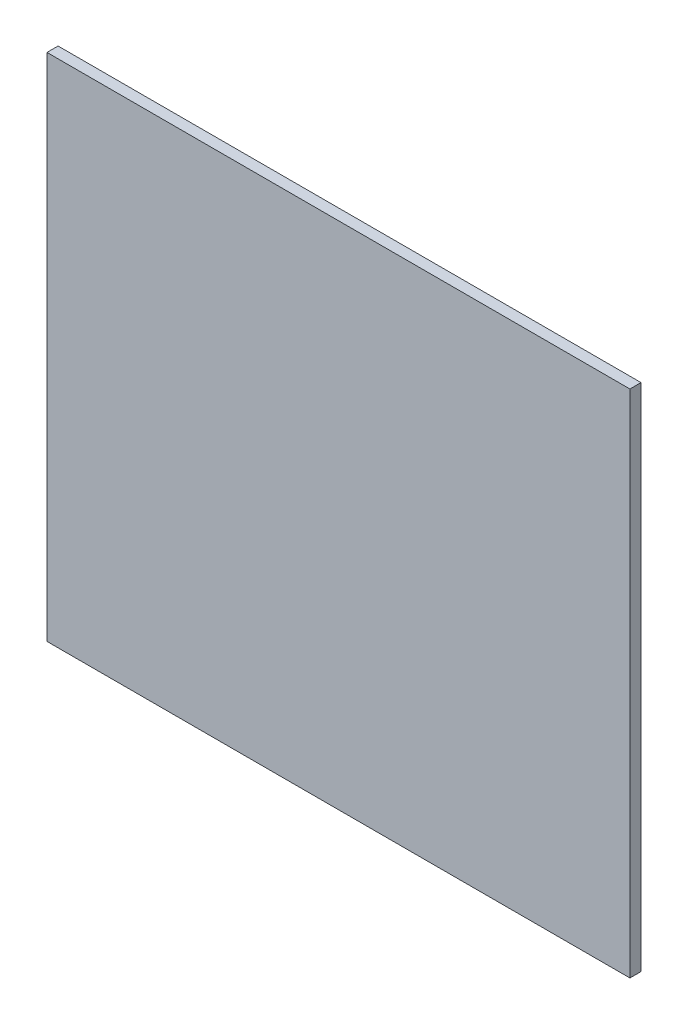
ISO-10303-21;
HEADER;
FILE_DESCRIPTION(('STEP AP214'),'2;1');
FILE_NAME('part.step','',(''),(''),'','','');
FILE_SCHEMA(('AUTOMOTIVE_DESIGN { 1 0 10303 214 1 1 1 1 }'));
ENDSEC;
DATA;
#1=APPLICATION_CONTEXT('core data for automotive mechanical design processes');
#2=APPLICATION_PROTOCOL_DEFINITION('international standard','automotive_design',2000,#1);
#3=PRODUCT_CONTEXT('',#1,'mechanical');
#4=PRODUCT('Part','Part','',(#3));
#5=PRODUCT_RELATED_PRODUCT_CATEGORY('part','',(#4));
#6=PRODUCT_DEFINITION_FORMATION('','',#4);
#7=PRODUCT_DEFINITION_CONTEXT('part definition',#1,'design');
#8=PRODUCT_DEFINITION('design','',#6,#7);
#9=PRODUCT_DEFINITION_SHAPE('','',#8);
#10=(LENGTH_UNIT() NAMED_UNIT(*) SI_UNIT(.MILLI.,.METRE.));
#11=(NAMED_UNIT(*) PLANE_ANGLE_UNIT() SI_UNIT($,.RADIAN.));
#12=(NAMED_UNIT(*) SI_UNIT($,.STERADIAN.) SOLID_ANGLE_UNIT());
#13=UNCERTAINTY_MEASURE_WITH_UNIT(LENGTH_MEASURE(1.E-05),#10,'distance_accuracy_value','');
#14=(GEOMETRIC_REPRESENTATION_CONTEXT(3) GLOBAL_UNCERTAINTY_ASSIGNED_CONTEXT((#13)) GLOBAL_UNIT_ASSIGNED_CONTEXT((#10,
#11,#12)) REPRESENTATION_CONTEXT('',''));
#15=CARTESIAN_POINT('',(0.,0.,0.));
#16=DIRECTION('',(0.,0.,1.));
#17=DIRECTION('',(1.,0.,0.));
#18=AXIS2_PLACEMENT_3D('',#15,#16,#17);
#19=CARTESIAN_POINT('',(11.8000500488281,17.1,-0.03048));
#20=DIRECTION('',(0.,-1.,0.));
#21=DIRECTION('',(0.,0.,-1.));
#22=AXIS2_PLACEMENT_3D('',#19,#20,#21);
#23=PLANE('',#22);
#24=DIRECTION('',(1.,0.,0.));
#25=VECTOR('',#24,1.);
#26=CARTESIAN_POINT('',(12.6,17.1,0.));
#27=LINE('',#26,#25);
#28=CARTESIAN_POINT('',(11.8000500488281,17.1,0.));
#29=VERTEX_POINT('',#28);
#30=CARTESIAN_POINT('',(13.3999499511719,17.1,0.));
#31=VERTEX_POINT('',#30);
#32=EDGE_CURVE('E112',#29,#31,#27,.T.);
#33=ORIENTED_EDGE('',*,*,#32,.T.);
#34=DIRECTION('',(0.,0.,-1.));
#35=VECTOR('',#34,1.);
#36=CARTESIAN_POINT('',(13.3999499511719,17.1,-0.01524));
#37=LINE('',#36,#35);
#38=CARTESIAN_POINT('',(13.3999499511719,17.1,-0.03048));
#39=VERTEX_POINT('',#38);
#40=EDGE_CURVE('E87',#31,#39,#37,.T.);
#41=ORIENTED_EDGE('',*,*,#40,.T.);
#42=DIRECTION('',(1.,0.,0.));
#43=VECTOR('',#42,1.);
#44=CARTESIAN_POINT('',(11.8000500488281,17.1,-0.03048));
#45=LINE('',#44,#43);
#46=CARTESIAN_POINT('',(11.8000500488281,17.1,-0.03048));
#47=VERTEX_POINT('',#46);
#48=EDGE_CURVE('E83',#47,#39,#45,.T.);
#49=ORIENTED_EDGE('',*,*,#48,.F.);
#50=DIRECTION('',(0.,0.,-1.));
#51=VECTOR('',#50,1.);
#52=CARTESIAN_POINT('',(11.8000500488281,17.1,-0.01524));
#53=LINE('',#52,#51);
#54=EDGE_CURVE('E11',#29,#47,#53,.T.);
#55=ORIENTED_EDGE('',*,*,#54,.F.);
#56=EDGE_LOOP('',(#33,#41,#49,#55));
#57=FACE_BOUND('',#56,.T.);
#58=ADVANCED_FACE('F17',(#57),#23,.F.);
#59=CARTESIAN_POINT('',(11.8000500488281,15.7,-0.03048));
#60=DIRECTION('',(1.,0.,0.));
#61=DIRECTION('',(0.,1.,0.));
#62=AXIS2_PLACEMENT_3D('',#59,#60,#61);
#63=PLANE('',#62);
#64=DIRECTION('',(0.,1.,0.));
#65=VECTOR('',#64,1.);
#66=CARTESIAN_POINT('',(11.8000500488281,16.4,0.));
#67=LINE('',#66,#65);
#68=CARTESIAN_POINT('',(11.8000500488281,15.7,0.));
#69=VERTEX_POINT('',#68);
#70=EDGE_CURVE('E74',#69,#29,#67,.T.);
#71=ORIENTED_EDGE('',*,*,#70,.T.);
#72=ORIENTED_EDGE('',*,*,#54,.T.);
#73=DIRECTION('',(0.,1.,0.));
#74=VECTOR('',#73,1.);
#75=CARTESIAN_POINT('',(11.8000500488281,15.7,-0.03048));
#76=LINE('',#75,#74);
#77=CARTESIAN_POINT('',(11.8000500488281,15.7,-0.03048));
#78=VERTEX_POINT('',#77);
#79=EDGE_CURVE('E71',#78,#47,#76,.T.);
#80=ORIENTED_EDGE('',*,*,#79,.F.);
#81=DIRECTION('',(0.,0.,-1.));
#82=VECTOR('',#81,1.);
#83=CARTESIAN_POINT('',(11.8000500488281,15.7,-0.01524));
#84=LINE('',#83,#82);
#85=EDGE_CURVE('E25',#69,#78,#84,.T.);
#86=ORIENTED_EDGE('',*,*,#85,.F.);
#87=EDGE_LOOP('',(#71,#72,#80,#86));
#88=FACE_BOUND('',#87,.T.);
#89=ADVANCED_FACE('F70',(#88),#63,.F.);
#90=CARTESIAN_POINT('',(13.3999499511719,15.7,-0.03048));
#91=DIRECTION('',(0.,1.,0.));
#92=DIRECTION('',(1.,0.,0.));
#93=AXIS2_PLACEMENT_3D('',#90,#91,#92);
#94=PLANE('',#93);
#95=DIRECTION('',(-1.,0.,0.));
#96=VECTOR('',#95,1.);
#97=CARTESIAN_POINT('',(12.6,15.7,0.));
#98=LINE('',#97,#96);
#99=CARTESIAN_POINT('',(13.3999499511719,15.7,0.));
#100=VERTEX_POINT('',#99);
#101=EDGE_CURVE('E97',#100,#69,#98,.T.);
#102=ORIENTED_EDGE('',*,*,#101,.T.);
#103=ORIENTED_EDGE('',*,*,#85,.T.);
#104=DIRECTION('',(-1.,0.,0.));
#105=VECTOR('',#104,1.);
#106=CARTESIAN_POINT('',(13.3999499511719,15.7,-0.03048));
#107=LINE('',#106,#105);
#108=CARTESIAN_POINT('',(13.3999499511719,15.7,-0.03048));
#109=VERTEX_POINT('',#108);
#110=EDGE_CURVE('E84',#109,#78,#107,.T.);
#111=ORIENTED_EDGE('',*,*,#110,.F.);
#112=DIRECTION('',(0.,0.,-1.));
#113=VECTOR('',#112,1.);
#114=CARTESIAN_POINT('',(13.3999499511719,15.7,-0.01524));
#115=LINE('',#114,#113);
#116=EDGE_CURVE('E49',#100,#109,#115,.T.);
#117=ORIENTED_EDGE('',*,*,#116,.F.);
#118=EDGE_LOOP('',(#102,#103,#111,#117));
#119=FACE_BOUND('',#118,.T.);
#120=ADVANCED_FACE('F131',(#119),#94,.F.);
#121=CARTESIAN_POINT('',(13.3999499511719,17.1,-0.03048));
#122=DIRECTION('',(-1.,0.,0.));
#123=DIRECTION('',(0.,0.,1.));
#124=AXIS2_PLACEMENT_3D('',#121,#122,#123);
#125=PLANE('',#124);
#126=DIRECTION('',(0.,-1.,0.));
#127=VECTOR('',#126,1.);
#128=CARTESIAN_POINT('',(13.3999499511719,16.4,0.));
#129=LINE('',#128,#127);
#130=EDGE_CURVE('E90',#31,#100,#129,.T.);
#131=ORIENTED_EDGE('',*,*,#130,.T.);
#132=ORIENTED_EDGE('',*,*,#116,.T.);
#133=DIRECTION('',(0.,-1.,0.));
#134=VECTOR('',#133,1.);
#135=CARTESIAN_POINT('',(13.3999499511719,17.1,-0.03048));
#136=LINE('',#135,#134);
#137=EDGE_CURVE('E89',#39,#109,#136,.T.);
#138=ORIENTED_EDGE('',*,*,#137,.F.);
#139=ORIENTED_EDGE('',*,*,#40,.F.);
#140=EDGE_LOOP('',(#131,#132,#138,#139));
#141=FACE_BOUND('',#140,.T.);
#142=ADVANCED_FACE('F136',(#141),#125,.F.);
#143=CARTESIAN_POINT('',(12.6,16.4,-0.03048));
#144=DIRECTION('',(0.,0.,1.));
#145=DIRECTION('',(1.,0.,0.));
#146=AXIS2_PLACEMENT_3D('',#143,#144,#145);
#147=PLANE('',#146);
#148=ORIENTED_EDGE('',*,*,#48,.T.);
#149=ORIENTED_EDGE('',*,*,#137,.T.);
#150=ORIENTED_EDGE('',*,*,#110,.T.);
#151=ORIENTED_EDGE('',*,*,#79,.T.);
#152=EDGE_LOOP('',(#148,#149,#150,#151));
#153=FACE_BOUND('',#152,.T.);
#154=ADVANCED_FACE('F81',(#153),#147,.F.);
#155=CARTESIAN_POINT('',(12.6,16.4,0.));
#156=DIRECTION('',(0.,0.,1.));
#157=DIRECTION('',(1.,0.,0.));
#158=AXIS2_PLACEMENT_3D('',#155,#156,#157);
#159=PLANE('',#158);
#160=ORIENTED_EDGE('',*,*,#32,.F.);
#161=ORIENTED_EDGE('',*,*,#70,.F.);
#162=ORIENTED_EDGE('',*,*,#101,.F.);
#163=ORIENTED_EDGE('',*,*,#130,.F.);
#164=EDGE_LOOP('',(#160,#161,#162,#163));
#165=FACE_BOUND('',#164,.T.);
#166=ADVANCED_FACE('F117',(#165),#159,.T.);
#167=CLOSED_SHELL('',(#58,#89,#120,#142,#154,#166));
#168=MANIFOLD_SOLID_BREP('B1',#167);
#169=ADVANCED_BREP_SHAPE_REPRESENTATION('',(#18,#168),#14);
#170=SHAPE_DEFINITION_REPRESENTATION(#9,#169);
ENDSEC;
END-ISO-10303-21;
